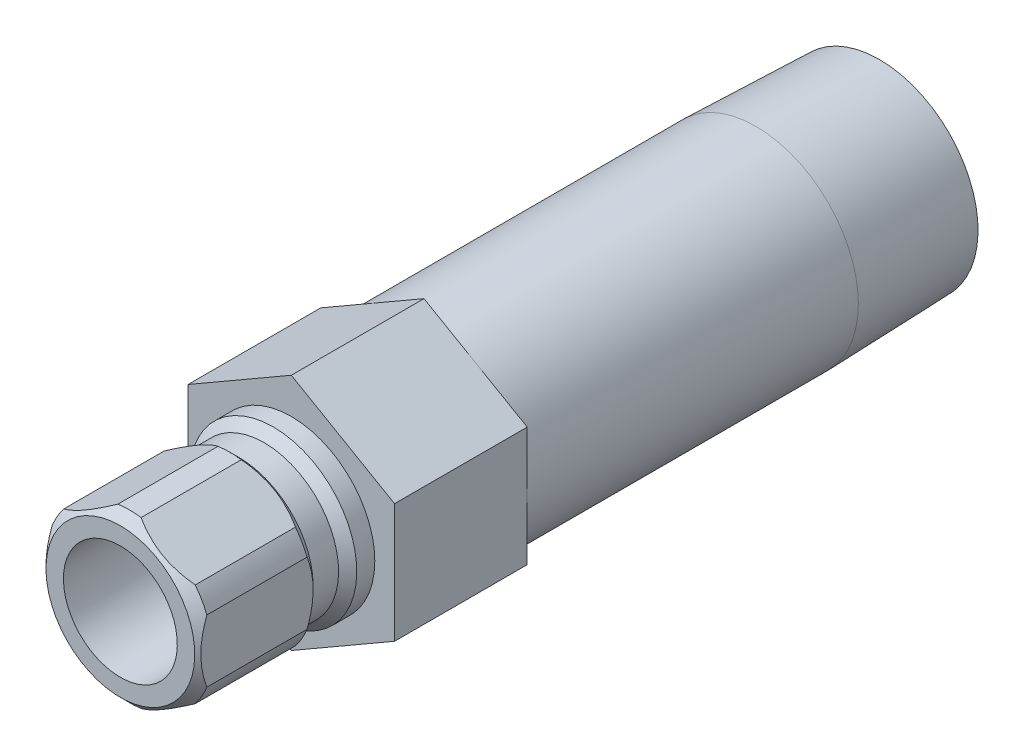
ISO-10303-21;
HEADER;
FILE_DESCRIPTION(('STEP AP214'),'2;1');
FILE_NAME('part.step','',(''),(''),'','','');
FILE_SCHEMA(('AUTOMOTIVE_DESIGN { 1 0 10303 214 1 1 1 1 }'));
ENDSEC;
DATA;
#1=APPLICATION_CONTEXT('core data for automotive mechanical design processes');
#2=APPLICATION_PROTOCOL_DEFINITION('international standard','automotive_design',2000,#1);
#3=PRODUCT_CONTEXT('',#1,'mechanical');
#4=PRODUCT('Part','Part','',(#3));
#5=PRODUCT_RELATED_PRODUCT_CATEGORY('part','',(#4));
#6=PRODUCT_DEFINITION_FORMATION('','',#4);
#7=PRODUCT_DEFINITION_CONTEXT('part definition',#1,'design');
#8=PRODUCT_DEFINITION('design','',#6,#7);
#9=PRODUCT_DEFINITION_SHAPE('','',#8);
#10=(LENGTH_UNIT() NAMED_UNIT(*) SI_UNIT(.MILLI.,.METRE.));
#11=(NAMED_UNIT(*) PLANE_ANGLE_UNIT() SI_UNIT($,.RADIAN.));
#12=(NAMED_UNIT(*) SI_UNIT($,.STERADIAN.) SOLID_ANGLE_UNIT());
#13=UNCERTAINTY_MEASURE_WITH_UNIT(LENGTH_MEASURE(1.E-05),#10,'distance_accuracy_value','');
#14=(GEOMETRIC_REPRESENTATION_CONTEXT(3) GLOBAL_UNCERTAINTY_ASSIGNED_CONTEXT((#13)) GLOBAL_UNIT_ASSIGNED_CONTEXT((#10,
#11,#12)) REPRESENTATION_CONTEXT('',''));
#15=CARTESIAN_POINT('',(0.,0.,0.));
#16=DIRECTION('',(0.,0.,1.));
#17=DIRECTION('',(1.,0.,0.));
#18=AXIS2_PLACEMENT_3D('',#15,#16,#17);
#19=CARTESIAN_POINT('',(0.,0.,0.));
#20=DIRECTION('',(0.,0.,-1.));
#21=DIRECTION('',(0.,1.,0.));
#22=AXIS2_PLACEMENT_3D('',#19,#20,#21);
#23=CYLINDRICAL_SURFACE('',#22,6.985);
#24=DIRECTION('',(0.,0.,-1.));
#25=VECTOR('',#24,1.);
#26=CARTESIAN_POINT('',(5.50323442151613,-4.30170151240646,0.));
#27=LINE('',#26,#25);
#28=CARTESIAN_POINT('',(5.50323442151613,-4.30170151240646,5.1562));
#29=VERTEX_POINT('',#28);
#30=CARTESIAN_POINT('',(5.50323442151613,-4.30170151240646,13.5382));
#31=VERTEX_POINT('',#30);
#32=EDGE_CURVE('E405',#29,#31,#27,.F.);
#33=ORIENTED_EDGE('',*,*,#32,.F.);
#34=CARTESIAN_POINT('',(0.,0.,5.1562));
#35=DIRECTION('',(0.,0.,-1.));
#36=DIRECTION('',(0.,1.,0.));
#37=AXIS2_PLACEMENT_3D('',#34,#35,#36);
#38=CIRCLE('',#37,6.985);
#39=CARTESIAN_POINT('',(6.477,-2.6150900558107,5.1562));
#40=VERTEX_POINT('',#39);
#41=EDGE_CURVE('E382',#40,#29,#38,.T.);
#42=ORIENTED_EDGE('',*,*,#41,.F.);
#43=DIRECTION('',(0.,0.,-1.));
#44=VECTOR('',#43,1.);
#45=CARTESIAN_POINT('',(6.477,-2.6150900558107,0.));
#46=LINE('',#45,#44);
#47=CARTESIAN_POINT('',(6.477,-2.6150900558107,13.5382));
#48=VERTEX_POINT('',#47);
#49=EDGE_CURVE('E396',#48,#40,#46,.T.);
#50=ORIENTED_EDGE('',*,*,#49,.F.);
#51=CARTESIAN_POINT('',(0.,0.,13.5382));
#52=DIRECTION('',(0.,0.,-1.));
#53=DIRECTION('',(0.,1.,0.));
#54=AXIS2_PLACEMENT_3D('',#51,#52,#53);
#55=CIRCLE('',#54,6.985);
#56=EDGE_CURVE('E190',#48,#31,#55,.T.);
#57=ORIENTED_EDGE('',*,*,#56,.T.);
#58=EDGE_LOOP('',(#33,#42,#50,#57));
#59=FACE_BOUND('',#58,.T.);
#60=ADVANCED_FACE('F33',(#59),#23,.T.);
#61=DIRECTION('',(0.,0.,-1.));
#62=VECTOR('',#61,1.);
#63=CARTESIAN_POINT('',(6.477,2.61509005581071,0.));
#64=LINE('',#63,#62);
#65=CARTESIAN_POINT('',(6.477,2.6150900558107,5.1562));
#66=VERTEX_POINT('',#65);
#67=CARTESIAN_POINT('',(6.477,2.61509005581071,13.5382));
#68=VERTEX_POINT('',#67);
#69=EDGE_CURVE('E308',#66,#68,#64,.F.);
#70=ORIENTED_EDGE('',*,*,#69,.F.);
#71=CARTESIAN_POINT('',(5.50323442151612,4.30170151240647,5.1562));
#72=VERTEX_POINT('',#71);
#73=EDGE_CURVE('E203',#72,#66,#38,.T.);
#74=ORIENTED_EDGE('',*,*,#73,.F.);
#75=DIRECTION('',(0.,0.,-1.));
#76=VECTOR('',#75,1.);
#77=CARTESIAN_POINT('',(5.50323442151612,4.30170151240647,0.));
#78=LINE('',#77,#76);
#79=CARTESIAN_POINT('',(5.50323442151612,4.30170151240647,13.5382));
#80=VERTEX_POINT('',#79);
#81=EDGE_CURVE('E393',#80,#72,#78,.T.);
#82=ORIENTED_EDGE('',*,*,#81,.F.);
#83=EDGE_CURVE('E197',#80,#68,#55,.T.);
#84=ORIENTED_EDGE('',*,*,#83,.T.);
#85=EDGE_LOOP('',(#70,#74,#82,#84));
#86=FACE_BOUND('',#85,.T.);
#87=ADVANCED_FACE('F342',(#86),#23,.T.);
#88=DIRECTION('',(0.,0.,-1.));
#89=VECTOR('',#88,1.);
#90=CARTESIAN_POINT('',(0.973765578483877,6.91679156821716,0.));
#91=LINE('',#90,#89);
#92=CARTESIAN_POINT('',(0.973765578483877,6.91679156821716,5.1562));
#93=VERTEX_POINT('',#92);
#94=CARTESIAN_POINT('',(0.973765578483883,6.91679156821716,13.5382));
#95=VERTEX_POINT('',#94);
#96=EDGE_CURVE('E398',#93,#95,#91,.F.);
#97=ORIENTED_EDGE('',*,*,#96,.F.);
#98=CARTESIAN_POINT('',(-0.973765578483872,6.91679156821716,5.1562));
#99=VERTEX_POINT('',#98);
#100=EDGE_CURVE('E199',#99,#93,#38,.T.);
#101=ORIENTED_EDGE('',*,*,#100,.F.);
#102=DIRECTION('',(0.,0.,-1.));
#103=VECTOR('',#102,1.);
#104=CARTESIAN_POINT('',(-0.973765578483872,6.91679156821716,0.));
#105=LINE('',#104,#103);
#106=CARTESIAN_POINT('',(-0.973765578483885,6.91679156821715,13.5382));
#107=VERTEX_POINT('',#106);
#108=EDGE_CURVE('E374',#107,#99,#105,.T.);
#109=ORIENTED_EDGE('',*,*,#108,.F.);
#110=EDGE_CURVE('E192',#107,#95,#55,.T.);
#111=ORIENTED_EDGE('',*,*,#110,.T.);
#112=EDGE_LOOP('',(#97,#101,#109,#111));
#113=FACE_BOUND('',#112,.T.);
#114=ADVANCED_FACE('F347',(#113),#23,.T.);
#115=DIRECTION('',(0.,0.,-1.));
#116=VECTOR('',#115,1.);
#117=CARTESIAN_POINT('',(-5.50323442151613,4.30170151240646,0.));
#118=LINE('',#117,#116);
#119=CARTESIAN_POINT('',(-5.50323442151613,4.30170151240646,5.1562));
#120=VERTEX_POINT('',#119);
#121=CARTESIAN_POINT('',(-5.50323442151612,4.30170151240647,13.5382));
#122=VERTEX_POINT('',#121);
#123=EDGE_CURVE('E53',#120,#122,#118,.F.);
#124=ORIENTED_EDGE('',*,*,#123,.F.);
#125=CARTESIAN_POINT('',(-6.477,2.61509005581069,5.1562));
#126=VERTEX_POINT('',#125);
#127=EDGE_CURVE('E202',#126,#120,#38,.T.);
#128=ORIENTED_EDGE('',*,*,#127,.F.);
#129=DIRECTION('',(0.,0.,-1.));
#130=VECTOR('',#129,1.);
#131=CARTESIAN_POINT('',(-6.477,2.61509005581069,0.));
#132=LINE('',#131,#130);
#133=CARTESIAN_POINT('',(-6.477,2.61509005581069,13.5382));
#134=VERTEX_POINT('',#133);
#135=EDGE_CURVE('E262',#134,#126,#132,.T.);
#136=ORIENTED_EDGE('',*,*,#135,.F.);
#137=EDGE_CURVE('E188',#134,#122,#55,.T.);
#138=ORIENTED_EDGE('',*,*,#137,.T.);
#139=EDGE_LOOP('',(#124,#128,#136,#138));
#140=FACE_BOUND('',#139,.T.);
#141=ADVANCED_FACE('F359',(#140),#23,.T.);
#142=DIRECTION('',(0.,0.,-1.));
#143=VECTOR('',#142,1.);
#144=CARTESIAN_POINT('',(-6.477,-2.61509005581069,0.));
#145=LINE('',#144,#143);
#146=CARTESIAN_POINT('',(-6.477,-2.61509005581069,5.1562));
#147=VERTEX_POINT('',#146);
#148=CARTESIAN_POINT('',(-6.477,-2.6150900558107,13.5382));
#149=VERTEX_POINT('',#148);
#150=EDGE_CURVE('E61',#147,#149,#145,.F.);
#151=ORIENTED_EDGE('',*,*,#150,.F.);
#152=CARTESIAN_POINT('',(-5.50323442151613,-4.30170151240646,5.1562));
#153=VERTEX_POINT('',#152);
#154=EDGE_CURVE('E181',#153,#147,#38,.T.);
#155=ORIENTED_EDGE('',*,*,#154,.F.);
#156=DIRECTION('',(0.,0.,-1.));
#157=VECTOR('',#156,1.);
#158=CARTESIAN_POINT('',(-5.50323442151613,-4.30170151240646,0.));
#159=LINE('',#158,#157);
#160=CARTESIAN_POINT('',(-5.50323442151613,-4.30170151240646,13.5382));
#161=VERTEX_POINT('',#160);
#162=EDGE_CURVE('E164',#161,#153,#159,.T.);
#163=ORIENTED_EDGE('',*,*,#162,.F.);
#164=EDGE_CURVE('E179',#161,#149,#55,.T.);
#165=ORIENTED_EDGE('',*,*,#164,.T.);
#166=EDGE_LOOP('',(#151,#155,#163,#165));
#167=FACE_BOUND('',#166,.T.);
#168=ADVANCED_FACE('F178',(#167),#23,.T.);
#169=CARTESIAN_POINT('',(0.,0.,0.));
#170=DIRECTION('',(0.,0.,-1.));
#171=DIRECTION('',(0.,1.,0.));
#172=AXIS2_PLACEMENT_3D('',#169,#170,#171);
#173=CYLINDRICAL_SURFACE('',#172,8.57249999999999);
#174=CARTESIAN_POINT('',(0.,0.,-38.862));
#175=DIRECTION('',(0.,0.,-1.));
#176=DIRECTION('',(0.,1.,0.));
#177=AXIS2_PLACEMENT_3D('',#174,#175,#176);
#178=CIRCLE('',#177,8.57249999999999);
#179=CARTESIAN_POINT('',(0.,8.5725,-38.862));
#180=VERTEX_POINT('',#179);
#181=EDGE_CURVE('E213',#180,#180,#178,.T.);
#182=ORIENTED_EDGE('',*,*,#181,.F.);
#183=EDGE_LOOP('',(#182));
#184=FACE_BOUND('',#183,.T.);
#185=CARTESIAN_POINT('',(0.,0.,-11.0998));
#186=DIRECTION('',(0.,0.,1.));
#187=DIRECTION('',(1.,0.,0.));
#188=AXIS2_PLACEMENT_3D('',#185,#186,#187);
#189=CIRCLE('',#188,8.57249999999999);
#190=CARTESIAN_POINT('',(8.57249999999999,0.,-11.0998));
#191=VERTEX_POINT('',#190);
#192=EDGE_CURVE('E230',#191,#191,#189,.F.);
#193=ORIENTED_EDGE('',*,*,#192,.T.);
#194=EDGE_LOOP('',(#193));
#195=FACE_BOUND('',#194,.T.);
#196=ADVANCED_FACE('F358',(#184,#195),#173,.T.);
#197=CARTESIAN_POINT('',(0.,0.,0.));
#198=DIRECTION('',(0.,0.,-1.));
#199=DIRECTION('',(0.,1.,0.));
#200=AXIS2_PLACEMENT_3D('',#197,#198,#199);
#201=CYLINDRICAL_SURFACE('',#200,4.7625);
#202=CARTESIAN_POINT('',(0.,0.,14.3002));
#203=DIRECTION('',(0.,0.,-1.));
#204=DIRECTION('',(0.,1.,0.));
#205=AXIS2_PLACEMENT_3D('',#202,#203,#204);
#206=CIRCLE('',#205,4.7625);
#207=CARTESIAN_POINT('',(0.,4.7625,14.3002));
#208=VERTEX_POINT('',#207);
#209=EDGE_CURVE('E232',#208,#208,#206,.T.);
#210=ORIENTED_EDGE('',*,*,#209,.F.);
#211=EDGE_LOOP('',(#210));
#212=FACE_BOUND('',#211,.T.);
#213=CARTESIAN_POINT('',(0.,0.,-11.0998));
#214=DIRECTION('',(0.,0.,-1.));
#215=DIRECTION('',(0.,1.,0.));
#216=AXIS2_PLACEMENT_3D('',#213,#214,#215);
#217=CIRCLE('',#216,4.7625);
#218=CARTESIAN_POINT('',(0.,4.7625,-11.0998));
#219=VERTEX_POINT('',#218);
#220=EDGE_CURVE('E225',#219,#219,#217,.T.);
#221=ORIENTED_EDGE('',*,*,#220,.T.);
#222=EDGE_LOOP('',(#221));
#223=FACE_BOUND('',#222,.T.);
#224=ADVANCED_FACE('F35',(#212,#223),#201,.F.);
#225=CARTESIAN_POINT('',(0.,4.7625,-11.0998));
#226=DIRECTION('',(0.,0.,-1.));
#227=DIRECTION('',(0.,1.,0.));
#228=AXIS2_PLACEMENT_3D('',#225,#226,#227);
#229=PLANE('',#228);
#230=CARTESIAN_POINT('',(0.,0.,-11.0998));
#231=DIRECTION('',(0.,0.,-1.));
#232=DIRECTION('',(0.,1.,0.));
#233=AXIS2_PLACEMENT_3D('',#230,#231,#232);
#234=CIRCLE('',#233,6.2611);
#235=CARTESIAN_POINT('',(0.,6.2611,-11.0998));
#236=VERTEX_POINT('',#235);
#237=EDGE_CURVE('E222',#236,#236,#234,.T.);
#238=ORIENTED_EDGE('',*,*,#237,.T.);
#239=EDGE_LOOP('',(#238));
#240=FACE_BOUND('',#239,.T.);
#241=ORIENTED_EDGE('',*,*,#220,.F.);
#242=EDGE_LOOP('',(#241));
#243=FACE_BOUND('',#242,.T.);
#244=ADVANCED_FACE('F686',(#240,#243),#229,.T.);
#245=CARTESIAN_POINT('',(0.,0.,0.));
#246=DIRECTION('',(0.,0.,-1.));
#247=DIRECTION('',(0.,1.,0.));
#248=AXIS2_PLACEMENT_3D('',#245,#246,#247);
#249=CYLINDRICAL_SURFACE('',#248,6.26109999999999);
#250=CARTESIAN_POINT('',(0.,0.,-49.1998));
#251=DIRECTION('',(0.,0.,-1.));
#252=DIRECTION('',(0.,1.,0.));
#253=AXIS2_PLACEMENT_3D('',#250,#251,#252);
#254=CIRCLE('',#253,6.26109999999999);
#255=CARTESIAN_POINT('',(0.,6.2611,-49.1998));
#256=VERTEX_POINT('',#255);
#257=EDGE_CURVE('E219',#256,#256,#254,.T.);
#258=ORIENTED_EDGE('',*,*,#257,.T.);
#259=EDGE_LOOP('',(#258));
#260=FACE_BOUND('',#259,.T.);
#261=ORIENTED_EDGE('',*,*,#237,.F.);
#262=EDGE_LOOP('',(#261));
#263=FACE_BOUND('',#262,.T.);
#264=ADVANCED_FACE('F677',(#260,#263),#249,.F.);
#265=CARTESIAN_POINT('',(0.,8.24944566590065,-49.1998));
#266=DIRECTION('',(0.,0.,-1.));
#267=DIRECTION('',(0.,1.,0.));
#268=AXIS2_PLACEMENT_3D('',#265,#266,#267);
#269=PLANE('',#268);
#270=CARTESIAN_POINT('',(0.,0.,-49.1998));
#271=DIRECTION('',(0.,0.,-1.));
#272=DIRECTION('',(0.,1.,0.));
#273=AXIS2_PLACEMENT_3D('',#270,#271,#272);
#274=CIRCLE('',#273,8.24944566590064);
#275=CARTESIAN_POINT('',(0.,8.24944566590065,-49.1998));
#276=VERTEX_POINT('',#275);
#277=EDGE_CURVE('E216',#276,#276,#274,.T.);
#278=ORIENTED_EDGE('',*,*,#277,.T.);
#279=EDGE_LOOP('',(#278));
#280=FACE_BOUND('',#279,.T.);
#281=ORIENTED_EDGE('',*,*,#257,.F.);
#282=EDGE_LOOP('',(#281));
#283=FACE_BOUND('',#282,.T.);
#284=ADVANCED_FACE('F668',(#280,#283),#269,.T.);
#285=CARTESIAN_POINT('',(0.,0.,-49.1998));
#286=DIRECTION('',(0.,0.,1.));
#287=DIRECTION('',(0.,-1.,0.));
#288=AXIS2_PLACEMENT_3D('',#285,#286,#287);
#289=CONICAL_SURFACE('',#288,8.24944566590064,0.0312396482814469);
#290=ORIENTED_EDGE('',*,*,#181,.T.);
#291=EDGE_LOOP('',(#290));
#292=FACE_BOUND('',#291,.T.);
#293=ORIENTED_EDGE('',*,*,#277,.F.);
#294=EDGE_LOOP('',(#293));
#295=FACE_BOUND('',#294,.T.);
#296=ADVANCED_FACE('F660',(#292,#295),#289,.T.);
#297=CARTESIAN_POINT('',(0.,0.,0.));
#298=DIRECTION('',(0.,0.,-1.));
#299=DIRECTION('',(0.,1.,0.));
#300=AXIS2_PLACEMENT_3D('',#297,#298,#299);
#301=CYLINDRICAL_SURFACE('',#300,6.985);
#302=CARTESIAN_POINT('',(0.,0.,0.));
#303=DIRECTION('',(0.,0.,1.));
#304=DIRECTION('',(1.,0.,0.));
#305=AXIS2_PLACEMENT_3D('',#302,#303,#304);
#306=CIRCLE('',#305,6.985);
#307=CARTESIAN_POINT('',(6.985,0.,0.));
#308=VERTEX_POINT('',#307);
#309=EDGE_CURVE('E173',#308,#308,#306,.F.);
#310=ORIENTED_EDGE('',*,*,#309,.F.);
#311=EDGE_LOOP('',(#310));
#312=FACE_BOUND('',#311,.T.);
#313=CARTESIAN_POINT('',(0.,0.,1.50876));
#314=DIRECTION('',(0.,0.,-1.));
#315=DIRECTION('',(0.,1.,0.));
#316=AXIS2_PLACEMENT_3D('',#313,#314,#315);
#317=CIRCLE('',#316,6.985);
#318=CARTESIAN_POINT('',(0.,6.985,1.50876));
#319=VERTEX_POINT('',#318);
#320=EDGE_CURVE('E210',#319,#319,#317,.T.);
#321=ORIENTED_EDGE('',*,*,#320,.T.);
#322=EDGE_LOOP('',(#321));
#323=FACE_BOUND('',#322,.T.);
#324=ADVANCED_FACE('F652',(#312,#323),#301,.T.);
#325=CARTESIAN_POINT('',(0.,0.,1.50876));
#326=DIRECTION('',(0.,0.,-1.));
#327=DIRECTION('',(0.,1.,0.));
#328=AXIS2_PLACEMENT_3D('',#325,#326,#327);
#329=CONICAL_SURFACE('',#328,6.985,0.785398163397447);
#330=CARTESIAN_POINT('',(0.,0.,2.27076));
#331=DIRECTION('',(0.,0.,-1.));
#332=DIRECTION('',(0.,1.,0.));
#333=AXIS2_PLACEMENT_3D('',#330,#331,#332);
#334=CIRCLE('',#333,6.223);
#335=CARTESIAN_POINT('',(0.,6.223,2.27076));
#336=VERTEX_POINT('',#335);
#337=EDGE_CURVE('E207',#336,#336,#334,.T.);
#338=ORIENTED_EDGE('',*,*,#337,.T.);
#339=EDGE_LOOP('',(#338));
#340=FACE_BOUND('',#339,.T.);
#341=ORIENTED_EDGE('',*,*,#320,.F.);
#342=EDGE_LOOP('',(#341));
#343=FACE_BOUND('',#342,.T.);
#344=ADVANCED_FACE('F644',(#340,#343),#329,.T.);
#345=CARTESIAN_POINT('',(0.,0.,0.));
#346=DIRECTION('',(0.,0.,-1.));
#347=DIRECTION('',(0.,1.,0.));
#348=AXIS2_PLACEMENT_3D('',#345,#346,#347);
#349=CYLINDRICAL_SURFACE('',#348,6.223);
#350=CARTESIAN_POINT('',(0.,0.,4.3942));
#351=DIRECTION('',(0.,0.,-1.));
#352=DIRECTION('',(0.,1.,0.));
#353=AXIS2_PLACEMENT_3D('',#350,#351,#352);
#354=CIRCLE('',#353,6.223);
#355=CARTESIAN_POINT('',(0.,6.223,4.3942));
#356=VERTEX_POINT('',#355);
#357=EDGE_CURVE('E204',#356,#356,#354,.T.);
#358=ORIENTED_EDGE('',*,*,#357,.T.);
#359=EDGE_LOOP('',(#358));
#360=FACE_BOUND('',#359,.T.);
#361=ORIENTED_EDGE('',*,*,#337,.F.);
#362=EDGE_LOOP('',(#361));
#363=FACE_BOUND('',#362,.T.);
#364=ADVANCED_FACE('F269',(#360,#363),#349,.T.);
#365=CARTESIAN_POINT('',(0.,0.,4.3942));
#366=DIRECTION('',(0.,0.,1.));
#367=DIRECTION('',(0.,-1.,0.));
#368=AXIS2_PLACEMENT_3D('',#365,#366,#367);
#369=CONICAL_SURFACE('',#368,6.223,0.785398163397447);
#370=CARTESIAN_POINT('',(0.97330298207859,-6.91705864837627,5.1564));
#371=CARTESIAN_POINT('',(1.1543052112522,-6.81255696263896,5.07808330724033));
#372=CARTESIAN_POINT('',(1.3378209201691,-6.70660411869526,5.00684558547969));
#373=CARTESIAN_POINT('',(1.70963160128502,-6.49193912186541,4.88134753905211));
#374=CARTESIAN_POINT('',(1.89793754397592,-6.38322063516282,4.82713086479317));
#375=CARTESIAN_POINT('',(2.27146153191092,-6.16756646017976,4.74047563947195));
#376=CARTESIAN_POINT('',(2.45655498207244,-6.06070270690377,4.70733772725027));
#377=CARTESIAN_POINT('',(2.82844640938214,-5.8459910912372,4.66198043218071));
#378=CARTESIAN_POINT('',(3.0152419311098,-5.73814464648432,4.64973461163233));
#379=CARTESIAN_POINT('',(3.3948057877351,-5.51900335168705,4.64689437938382));
#380=CARTESIAN_POINT('',(3.58757842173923,-5.40770601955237,4.65698827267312));
#381=CARTESIAN_POINT('',(3.97148128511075,-5.18605959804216,4.69952919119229));
#382=CARTESIAN_POINT('',(4.16260891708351,-5.07571200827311,4.73200667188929));
#383=CARTESIAN_POINT('',(4.54854122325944,-4.85289388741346,4.81877263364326));
#384=CARTESIAN_POINT('',(4.74321398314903,-4.74049951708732,4.87383522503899));
#385=CARTESIAN_POINT('',(5.03141021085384,-4.57410934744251,4.97019209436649));
#386=CARTESIAN_POINT('',(5.12673323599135,-4.51907457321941,5.00455772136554));
#387=CARTESIAN_POINT('',(5.31613879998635,-4.40972121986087,5.07745547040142));
#388=CARTESIAN_POINT('',(5.41022179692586,-4.35540237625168,5.11598600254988));
#389=CARTESIAN_POINT('',(5.5036970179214,-4.30143443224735,5.1564));
#390=B_SPLINE_CURVE_WITH_KNOTS('',3,(#370,#371,#372,#373,#374,#375,#376,#377,#378,#379,#380,
#381,#382,#383,#384,#385,#386,#387,#388,#389),.UNSPECIFIED.,.F.,.F.,(4,2,2,2,2,2,2,2,2,4),(0.,
0.66981096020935,1.34132587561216,1.98920541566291,2.63626449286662,3.3035366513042,
3.9717185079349,4.66502165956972,5.01088265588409,5.35661208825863),.UNSPECIFIED.);
#391=CARTESIAN_POINT('',(0.973765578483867,-6.91679156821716,5.1562));
#392=VERTEX_POINT('',#391);
#393=EDGE_CURVE('E407',#392,#29,#390,.T.);
#394=ORIENTED_EDGE('',*,*,#393,.F.);
#395=CARTESIAN_POINT('',(-0.973765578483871,-6.91679156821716,5.1562));
#396=VERTEX_POINT('',#395);
#397=EDGE_CURVE('E380',#392,#396,#38,.T.);
#398=ORIENTED_EDGE('',*,*,#397,.T.);
#399=CARTESIAN_POINT('',(-5.50369701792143,-4.30143443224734,5.15640000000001));
#400=CARTESIAN_POINT('',(-5.32269478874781,-4.40593611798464,5.07808330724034));
#401=CARTESIAN_POINT('',(-5.13917907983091,-4.51188896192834,5.0068455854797));
#402=CARTESIAN_POINT('',(-4.767368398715,-4.72655395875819,4.88134753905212));
#403=CARTESIAN_POINT('',(-4.5790624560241,-4.83527244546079,4.82713086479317));
#404=CARTESIAN_POINT('',(-4.20553846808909,-5.05092662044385,4.74047563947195));
#405=CARTESIAN_POINT('',(-4.02044501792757,-5.15779037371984,4.70733772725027));
#406=CARTESIAN_POINT('',(-3.64855359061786,-5.37250198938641,4.66198043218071));
#407=CARTESIAN_POINT('',(-3.4617580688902,-5.48034843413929,4.64973461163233));
#408=CARTESIAN_POINT('',(-3.0821942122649,-5.69948972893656,4.64689437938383));
#409=CARTESIAN_POINT('',(-2.88942157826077,-5.81078706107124,4.65698827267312));
#410=CARTESIAN_POINT('',(-2.50551871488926,-6.03243348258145,4.69952919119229));
#411=CARTESIAN_POINT('',(-2.3143910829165,-6.1427810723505,4.73200667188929));
#412=CARTESIAN_POINT('',(-1.92845877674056,-6.36559919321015,4.81877263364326));
#413=CARTESIAN_POINT('',(-1.73378601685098,-6.47799356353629,4.87383522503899));
#414=CARTESIAN_POINT('',(-1.44558978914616,-6.6443837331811,4.97019209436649));
#415=CARTESIAN_POINT('',(-1.35026676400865,-6.69941850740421,5.00455772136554));
#416=CARTESIAN_POINT('',(-1.16086120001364,-6.80877186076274,5.07745547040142));
#417=CARTESIAN_POINT('',(-1.06677820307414,-6.86309070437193,5.11598600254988));
#418=CARTESIAN_POINT('',(-0.973302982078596,-6.91705864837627,5.1564));
#419=B_SPLINE_CURVE_WITH_KNOTS('',3,(#399,#400,#401,#402,#403,#404,#405,#406,#407,#408,#409,
#410,#411,#412,#413,#414,#415,#416,#417,#418),.UNSPECIFIED.,.F.,.F.,(4,2,2,2,2,2,2,2,2,4),(0.,
0.669810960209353,1.34132587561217,1.98920541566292,2.63626449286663,3.30353665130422,
3.97171850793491,4.66502165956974,5.01088265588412,5.35661208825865),.UNSPECIFIED.);
#420=EDGE_CURVE('E255',#153,#396,#419,.T.);
#421=ORIENTED_EDGE('',*,*,#420,.F.);
#422=ORIENTED_EDGE('',*,*,#154,.T.);
#423=CARTESIAN_POINT('',(-6.477,-7.50531717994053,8.08489330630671));
#424=CARTESIAN_POINT('',(-6.477,-7.32278230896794,7.94673378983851));
#425=CARTESIAN_POINT('',(-6.477,-7.13923073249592,7.80989578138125));
#426=CARTESIAN_POINT('',(-6.477,-6.76969107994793,7.53945615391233));
#427=CARTESIAN_POINT('',(-6.477,-6.58370240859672,7.40585534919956));
#428=CARTESIAN_POINT('',(-6.477,-6.20752484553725,7.14153325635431));
#429=CARTESIAN_POINT('',(-6.477,-6.01731457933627,7.01084228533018));
#430=CARTESIAN_POINT('',(-6.477,-5.63367369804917,6.75429124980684));
#431=CARTESIAN_POINT('',(-6.477,-5.44024331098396,6.62843084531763));
#432=CARTESIAN_POINT('',(-6.477,-5.03831720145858,6.37548971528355));
#433=CARTESIAN_POINT('',(-6.477,-4.8295984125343,6.24876164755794));
#434=CARTESIAN_POINT('',(-6.477,-4.40728395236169,6.00357587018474));
#435=CARTESIAN_POINT('',(-6.477,-4.19368750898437,5.88511948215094));
#436=CARTESIAN_POINT('',(-6.477,-3.7616267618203,5.6590284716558));
#437=CARTESIAN_POINT('',(-6.477,-3.54317924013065,5.55136202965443));
#438=CARTESIAN_POINT('',(-6.477,-3.100295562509,5.34926153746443));
#439=CARTESIAN_POINT('',(-6.477,-2.87586219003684,5.25482146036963));
#440=CARTESIAN_POINT('',(-6.477,-2.43955826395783,5.0897033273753));
#441=CARTESIAN_POINT('',(-6.477,-2.22819339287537,5.0177028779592));
#442=CARTESIAN_POINT('',(-6.477,-1.80033354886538,4.89065249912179));
#443=CARTESIAN_POINT('',(-6.477,-1.58383822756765,4.8356037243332));
#444=CARTESIAN_POINT('',(-6.477,-1.15063390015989,4.74626140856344));
#445=CARTESIAN_POINT('',(-6.477,-0.93400006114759,4.71160936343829));
#446=CARTESIAN_POINT('',(-6.477,-0.498364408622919,4.66374056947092));
#447=CARTESIAN_POINT('',(-6.477,-0.279363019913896,4.65052003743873));
#448=CARTESIAN_POINT('',(-6.477,0.150697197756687,4.64651642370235));
#449=CARTESIAN_POINT('',(-6.477,0.361748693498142,4.6549176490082));
#450=CARTESIAN_POINT('',(-6.477,0.782066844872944,4.69188275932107));
#451=CARTESIAN_POINT('',(-6.477,0.991333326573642,4.72044858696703));
#452=CARTESIAN_POINT('',(-6.477,1.41010575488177,4.79666246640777));
#453=CARTESIAN_POINT('',(-6.477,1.6195513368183,4.84463689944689));
#454=CARTESIAN_POINT('',(-6.477,2.03387291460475,4.95709535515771));
#455=CARTESIAN_POINT('',(-6.477,2.23874927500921,5.0215780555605));
#456=CARTESIAN_POINT('',(-6.477,2.66141718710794,5.17064013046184));
#457=CARTESIAN_POINT('',(-6.477,2.87875617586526,5.25648961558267));
#458=CARTESIAN_POINT('',(-6.477,3.30779766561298,5.44138196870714));
#459=CARTESIAN_POINT('',(-6.477,3.51949749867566,5.54043095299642));
#460=CARTESIAN_POINT('',(-6.477,3.93828980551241,5.74936705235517));
#461=CARTESIAN_POINT('',(-6.477,4.14536521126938,5.85928810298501));
#462=CARTESIAN_POINT('',(-6.477,4.5547539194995,6.0875403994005));
#463=CARTESIAN_POINT('',(-6.477,4.75706796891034,6.20587031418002));
#464=CARTESIAN_POINT('',(-6.477,5.1476137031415,6.44323908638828));
#465=CARTESIAN_POINT('',(-6.477,5.33604552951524,6.56195038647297));
#466=CARTESIAN_POINT('',(-6.477,5.70967381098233,6.80437488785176));
#467=CARTESIAN_POINT('',(-6.477,5.89487001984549,6.92808846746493));
#468=CARTESIAN_POINT('',(-6.477,6.26095063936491,7.17860412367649));
#469=CARTESIAN_POINT('',(-6.477,6.44185783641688,7.30537302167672));
#470=CARTESIAN_POINT('',(-6.477,6.80119835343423,7.56227065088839));
#471=CARTESIAN_POINT('',(-6.477,6.97963234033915,7.69239844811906));
#472=CARTESIAN_POINT('',(-6.477,7.15703038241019,7.82389977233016));
#473=B_SPLINE_CURVE_WITH_KNOTS('',3,(#423,#424,#425,#426,#427,#428,#429,#430,#431,#432,#433,
#434,#435,#436,#437,#438,#439,#440,#441,#442,#443,#444,#445,#446,#447,#448,#449,#450,#451,#452,
#453,#454,#455,#456,#457,#458,#459,#460,#461,#462,#463,#464,#465,#466,#467,#468,#469,#470,#471,
#472),.UNSPECIFIED.,.F.,.F.,(4,2,2,2,2,2,2,2,2,2,2,2,2,2,2,2,2,2,2,2,2,2,2,2,4),(0.,
0.686790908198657,1.37375281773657,2.06603541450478,2.75826919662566,3.49065471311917,
4.22315698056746,4.95343127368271,5.68337170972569,6.35265989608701,7.02199365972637,
7.67918147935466,8.33625327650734,8.96890298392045,9.6016136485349,10.2454384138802,
10.8892116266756,11.5897073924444,12.2905288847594,12.9936114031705,13.6965828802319,
14.3646145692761,15.0326968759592,15.6953618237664,16.3578444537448),.UNSPECIFIED.);
#474=EDGE_CURVE('E278',#126,#147,#473,.F.);
#475=ORIENTED_EDGE('',*,*,#474,.F.);
#476=ORIENTED_EDGE('',*,*,#127,.T.);
#477=CARTESIAN_POINT('',(-0.973302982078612,6.91705864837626,5.1564));
#478=CARTESIAN_POINT('',(-1.15430521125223,6.81255696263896,5.07808330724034));
#479=CARTESIAN_POINT('',(-1.33782092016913,6.70660411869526,5.00684558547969));
#480=CARTESIAN_POINT('',(-1.70963160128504,6.49193912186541,4.88134753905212));
#481=CARTESIAN_POINT('',(-1.89793754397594,6.38322063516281,4.82713086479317));
#482=CARTESIAN_POINT('',(-2.27146153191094,6.16756646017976,4.74047563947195));
#483=CARTESIAN_POINT('',(-2.45655498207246,6.06070270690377,4.70733772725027));
#484=CARTESIAN_POINT('',(-2.82844640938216,5.8459910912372,4.66198043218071));
#485=CARTESIAN_POINT('',(-3.01524193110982,5.73814464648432,4.64973461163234));
#486=CARTESIAN_POINT('',(-3.39480578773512,5.51900335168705,4.64689437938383));
#487=CARTESIAN_POINT('',(-3.58757842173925,5.40770601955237,4.65698827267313));
#488=CARTESIAN_POINT('',(-3.97148128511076,5.18605959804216,4.6995291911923));
#489=CARTESIAN_POINT('',(-4.16260891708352,5.07571200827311,4.7320066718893));
#490=CARTESIAN_POINT('',(-4.54854122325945,4.85289388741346,4.81877263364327));
#491=CARTESIAN_POINT('',(-4.74321398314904,4.74049951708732,4.873835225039));
#492=CARTESIAN_POINT('',(-5.03141021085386,4.57410934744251,4.9701920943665));
#493=CARTESIAN_POINT('',(-5.12673323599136,4.51907457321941,5.00455772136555));
#494=CARTESIAN_POINT('',(-5.31613879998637,4.40972121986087,5.07745547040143));
#495=CARTESIAN_POINT('',(-5.41022179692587,4.35540237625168,5.11598600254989));
#496=CARTESIAN_POINT('',(-5.50369701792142,4.30143443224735,5.15640000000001));
#497=B_SPLINE_CURVE_WITH_KNOTS('',3,(#477,#478,#479,#480,#481,#482,#483,#484,#485,#486,#487,
#488,#489,#490,#491,#492,#493,#494,#495,#496),.UNSPECIFIED.,.F.,.F.,(4,2,2,2,2,2,2,2,2,4),(0.,
0.669810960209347,1.34132587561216,1.9892054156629,2.63626449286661,3.30353665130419,
3.97171850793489,4.66502165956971,5.01088265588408,5.35661208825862),.UNSPECIFIED.);
#498=EDGE_CURVE('E285',#99,#120,#497,.T.);
#499=ORIENTED_EDGE('',*,*,#498,.F.);
#500=ORIENTED_EDGE('',*,*,#100,.T.);
#501=CARTESIAN_POINT('',(5.50369701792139,4.30143443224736,5.1564));
#502=CARTESIAN_POINT('',(5.32269478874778,4.40593611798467,5.07808330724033));
#503=CARTESIAN_POINT('',(5.13917907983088,4.51188896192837,5.00684558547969));
#504=CARTESIAN_POINT('',(4.76736839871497,4.72655395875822,4.88134753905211));
#505=CARTESIAN_POINT('',(4.57906245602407,4.83527244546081,4.82713086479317));
#506=CARTESIAN_POINT('',(4.20553846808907,5.05092662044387,4.74047563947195));
#507=CARTESIAN_POINT('',(4.02044501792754,5.15779037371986,4.70733772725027));
#508=CARTESIAN_POINT('',(3.64855359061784,5.37250198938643,4.66198043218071));
#509=CARTESIAN_POINT('',(3.46175806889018,5.48034843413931,4.64973461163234));
#510=CARTESIAN_POINT('',(3.08219421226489,5.69948972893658,4.64689437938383));
#511=CARTESIAN_POINT('',(2.88942157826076,5.81078706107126,4.65698827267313));
#512=CARTESIAN_POINT('',(2.50551871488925,6.03243348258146,4.6995291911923));
#513=CARTESIAN_POINT('',(2.31439108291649,6.14278107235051,4.7320066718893));
#514=CARTESIAN_POINT('',(1.92845877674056,6.36559919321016,4.81877263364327));
#515=CARTESIAN_POINT('',(1.73378601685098,6.47799356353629,4.87383522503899));
#516=CARTESIAN_POINT('',(1.44558978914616,6.6443837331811,4.97019209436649));
#517=CARTESIAN_POINT('',(1.35026676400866,6.69941850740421,5.00455772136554));
#518=CARTESIAN_POINT('',(1.16086120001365,6.80877186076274,5.07745547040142));
#519=CARTESIAN_POINT('',(1.06677820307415,6.86309070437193,5.11598600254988));
#520=CARTESIAN_POINT('',(0.97330298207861,6.91705864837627,5.1564));
#521=B_SPLINE_CURVE_WITH_KNOTS('',3,(#501,#502,#503,#504,#505,#506,#507,#508,#509,#510,#511,
#512,#513,#514,#515,#516,#517,#518,#519,#520),.UNSPECIFIED.,.F.,.F.,(4,2,2,2,2,2,2,2,2,4),(0.,
0.669810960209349,1.34132587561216,1.9892054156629,2.63626449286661,3.30353665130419,
3.97171850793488,4.66502165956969,5.01088265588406,5.35661208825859),.UNSPECIFIED.);
#522=EDGE_CURVE('E292',#72,#93,#521,.T.);
#523=ORIENTED_EDGE('',*,*,#522,.F.);
#524=ORIENTED_EDGE('',*,*,#73,.T.);
#525=CARTESIAN_POINT('',(6.477,-7.50531717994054,8.08489330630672));
#526=CARTESIAN_POINT('',(6.477,-7.32278230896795,7.94673378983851));
#527=CARTESIAN_POINT('',(6.477,-7.13923073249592,7.80989578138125));
#528=CARTESIAN_POINT('',(6.477,-6.76969107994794,7.53945615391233));
#529=CARTESIAN_POINT('',(6.477,-6.58370240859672,7.40585534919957));
#530=CARTESIAN_POINT('',(6.477,-6.20752484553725,7.14153325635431));
#531=CARTESIAN_POINT('',(6.477,-6.01731457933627,7.01084228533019));
#532=CARTESIAN_POINT('',(6.477,-5.63367369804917,6.75429124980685));
#533=CARTESIAN_POINT('',(6.477,-5.44024331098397,6.62843084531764));
#534=CARTESIAN_POINT('',(6.477,-5.03831720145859,6.37548971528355));
#535=CARTESIAN_POINT('',(6.477,-4.8295984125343,6.24876164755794));
#536=CARTESIAN_POINT('',(6.477,-4.4072839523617,6.00357587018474));
#537=CARTESIAN_POINT('',(6.477,-4.19368750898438,5.88511948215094));
#538=CARTESIAN_POINT('',(6.477,-3.7616267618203,5.6590284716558));
#539=CARTESIAN_POINT('',(6.477,-3.54317924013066,5.55136202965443));
#540=CARTESIAN_POINT('',(6.477,-3.100295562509,5.34926153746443));
#541=CARTESIAN_POINT('',(6.477,-2.87586219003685,5.25482146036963));
#542=CARTESIAN_POINT('',(6.477,-2.43955826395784,5.08970332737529));
#543=CARTESIAN_POINT('',(6.477,-2.22819339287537,5.0177028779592));
#544=CARTESIAN_POINT('',(6.477,-1.80033354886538,4.89065249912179));
#545=CARTESIAN_POINT('',(6.477,-1.58383822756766,4.8356037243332));
#546=CARTESIAN_POINT('',(6.477,-1.15063390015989,4.74626140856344));
#547=CARTESIAN_POINT('',(6.477,-0.934000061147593,4.71160936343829));
#548=CARTESIAN_POINT('',(6.477,-0.498364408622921,4.66374056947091));
#549=CARTESIAN_POINT('',(6.477,-0.279363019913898,4.65052003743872));
#550=CARTESIAN_POINT('',(6.477,0.150697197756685,4.64651642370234));
#551=CARTESIAN_POINT('',(6.477,0.36174869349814,4.6549176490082));
#552=CARTESIAN_POINT('',(6.477,0.782066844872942,4.69188275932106));
#553=CARTESIAN_POINT('',(6.477,0.99133332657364,4.72044858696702));
#554=CARTESIAN_POINT('',(6.477,1.41010575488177,4.79666246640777));
#555=CARTESIAN_POINT('',(6.477,1.6195513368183,4.84463689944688));
#556=CARTESIAN_POINT('',(6.477,2.03387291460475,4.95709535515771));
#557=CARTESIAN_POINT('',(6.477,2.23874927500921,5.02157805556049));
#558=CARTESIAN_POINT('',(6.477,2.66141718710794,5.17064013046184));
#559=CARTESIAN_POINT('',(6.477,2.87875617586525,5.25648961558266));
#560=CARTESIAN_POINT('',(6.477,3.30779766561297,5.44138196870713));
#561=CARTESIAN_POINT('',(6.477,3.51949749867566,5.54043095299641));
#562=CARTESIAN_POINT('',(6.477,3.93828980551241,5.74936705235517));
#563=CARTESIAN_POINT('',(6.477,4.14536521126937,5.859288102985));
#564=CARTESIAN_POINT('',(6.477,4.55475391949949,6.08754039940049));
#565=CARTESIAN_POINT('',(6.477,4.75706796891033,6.20587031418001));
#566=CARTESIAN_POINT('',(6.477,5.14761370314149,6.44323908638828));
#567=CARTESIAN_POINT('',(6.477,5.33604552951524,6.56195038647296));
#568=CARTESIAN_POINT('',(6.477,5.70967381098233,6.80437488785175));
#569=CARTESIAN_POINT('',(6.477,5.89487001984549,6.92808846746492));
#570=CARTESIAN_POINT('',(6.477,6.2609506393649,7.17860412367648));
#571=CARTESIAN_POINT('',(6.477,6.44185783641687,7.30537302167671));
#572=CARTESIAN_POINT('',(6.477,6.80119835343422,7.56227065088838));
#573=CARTESIAN_POINT('',(6.477,6.97963234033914,7.69239844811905));
#574=CARTESIAN_POINT('',(6.477,7.15703038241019,7.82389977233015));
#575=B_SPLINE_CURVE_WITH_KNOTS('',3,(#525,#526,#527,#528,#529,#530,#531,#532,#533,#534,#535,
#536,#537,#538,#539,#540,#541,#542,#543,#544,#545,#546,#547,#548,#549,#550,#551,#552,#553,#554,
#555,#556,#557,#558,#559,#560,#561,#562,#563,#564,#565,#566,#567,#568,#569,#570,#571,#572,#573,
#574),.UNSPECIFIED.,.F.,.F.,(4,2,2,2,2,2,2,2,2,2,2,2,2,2,2,2,2,2,2,2,2,2,2,2,4),(0.,
0.686790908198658,1.37375281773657,2.06603541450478,2.75826919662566,3.49065471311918,
4.22315698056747,4.95343127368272,5.6833717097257,6.35265989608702,7.02199365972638,
7.67918147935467,8.33625327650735,8.96890298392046,9.60161364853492,10.2454384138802,
10.8892116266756,11.5897073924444,12.2905288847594,12.9936114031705,13.6965828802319,
14.3646145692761,15.0326968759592,15.6953618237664,16.3578444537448),.UNSPECIFIED.);
#576=EDGE_CURVE('E300',#40,#66,#575,.T.);
#577=ORIENTED_EDGE('',*,*,#576,.F.);
#578=ORIENTED_EDGE('',*,*,#41,.T.);
#579=EDGE_LOOP('',(#394,#398,#421,#422,#475,#476,#499,#500,#523,#524,#577,#578));
#580=FACE_BOUND('',#579,.T.);
#581=ORIENTED_EDGE('',*,*,#357,.F.);
#582=EDGE_LOOP('',(#581));
#583=FACE_BOUND('',#582,.T.);
#584=ADVANCED_FACE('F264',(#580,#583),#369,.T.);
#585=DIRECTION('',(0.,0.,-1.));
#586=VECTOR('',#585,1.);
#587=CARTESIAN_POINT('',(0.973765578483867,-6.91679156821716,0.));
#588=LINE('',#587,#586);
#589=CARTESIAN_POINT('',(0.973765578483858,-6.91679156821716,13.5382));
#590=VERTEX_POINT('',#589);
#591=EDGE_CURVE('E307',#590,#392,#588,.T.);
#592=ORIENTED_EDGE('',*,*,#591,.F.);
#593=CARTESIAN_POINT('',(-0.973765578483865,-6.91679156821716,13.5382));
#594=VERTEX_POINT('',#593);
#595=EDGE_CURVE('E187',#590,#594,#55,.T.);
#596=ORIENTED_EDGE('',*,*,#595,.T.);
#597=DIRECTION('',(0.,0.,-1.));
#598=VECTOR('',#597,1.);
#599=CARTESIAN_POINT('',(-0.973765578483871,-6.91679156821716,0.));
#600=LINE('',#599,#598);
#601=EDGE_CURVE('E167',#396,#594,#600,.F.);
#602=ORIENTED_EDGE('',*,*,#601,.F.);
#603=ORIENTED_EDGE('',*,*,#397,.F.);
#604=EDGE_LOOP('',(#592,#596,#602,#603));
#605=FACE_BOUND('',#604,.T.);
#606=ADVANCED_FACE('F268',(#605),#23,.T.);
#607=CARTESIAN_POINT('',(0.,0.,13.5382));
#608=DIRECTION('',(0.,0.,-1.));
#609=DIRECTION('',(0.,1.,0.));
#610=AXIS2_PLACEMENT_3D('',#607,#608,#609);
#611=CONICAL_SURFACE('',#610,6.985,0.785398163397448);
#612=CARTESIAN_POINT('',(5.5036970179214,-4.30143443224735,13.538));
#613=CARTESIAN_POINT('',(5.32269478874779,-4.40593611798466,13.6163166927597));
#614=CARTESIAN_POINT('',(5.13917907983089,-4.51188896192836,13.6875544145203));
#615=CARTESIAN_POINT('',(4.76736839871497,-4.72655395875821,13.8130524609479));
#616=CARTESIAN_POINT('',(4.57906245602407,-4.8352724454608,13.8672691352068));
#617=CARTESIAN_POINT('',(4.20553846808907,-5.05092662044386,13.953924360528));
#618=CARTESIAN_POINT('',(4.02044501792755,-5.15779037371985,13.9870622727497));
#619=CARTESIAN_POINT('',(3.64855359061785,-5.37250198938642,14.0324195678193));
#620=CARTESIAN_POINT('',(3.46175806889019,-5.4803484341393,14.0446653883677));
#621=CARTESIAN_POINT('',(3.08219421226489,-5.69948972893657,14.0475056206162));
#622=CARTESIAN_POINT('',(2.88942157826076,-5.81078706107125,14.0374117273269));
#623=CARTESIAN_POINT('',(2.50551871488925,-6.03243348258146,13.9948708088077));
#624=CARTESIAN_POINT('',(2.31439108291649,-6.14278107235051,13.9623933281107));
#625=CARTESIAN_POINT('',(1.92845877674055,-6.36559919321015,13.8756273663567));
#626=CARTESIAN_POINT('',(1.73378601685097,-6.47799356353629,13.820564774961));
#627=CARTESIAN_POINT('',(1.44558978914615,-6.6443837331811,13.7242079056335));
#628=CARTESIAN_POINT('',(1.35026676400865,-6.69941850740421,13.6898422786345));
#629=CARTESIAN_POINT('',(1.16086120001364,-6.80877186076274,13.6169445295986));
#630=CARTESIAN_POINT('',(1.06677820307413,-6.86309070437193,13.5784139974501));
#631=CARTESIAN_POINT('',(0.973302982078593,-6.91705864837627,13.538));
#632=B_SPLINE_CURVE_WITH_KNOTS('',3,(#612,#613,#614,#615,#616,#617,#618,#619,#620,#621,#622,
#623,#624,#625,#626,#627,#628,#629,#630,#631),.UNSPECIFIED.,.F.,.F.,(4,2,2,2,2,2,2,2,2,4),(0.,
0.669810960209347,1.34132587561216,1.9892054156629,2.63626449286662,3.3035366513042,
3.97171850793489,4.66502165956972,5.01088265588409,5.35661208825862),.UNSPECIFIED.);
#633=EDGE_CURVE('E12',#31,#590,#632,.T.);
#634=ORIENTED_EDGE('',*,*,#633,.F.);
#635=ORIENTED_EDGE('',*,*,#56,.F.);
#636=CARTESIAN_POINT('',(6.477,-7.50531717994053,10.6095066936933));
#637=CARTESIAN_POINT('',(6.477,-7.32278230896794,10.7476662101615));
#638=CARTESIAN_POINT('',(6.477,-7.13923073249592,10.8845042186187));
#639=CARTESIAN_POINT('',(6.477,-6.76969107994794,11.1549438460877));
#640=CARTESIAN_POINT('',(6.477,-6.58370240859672,11.2885446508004));
#641=CARTESIAN_POINT('',(6.477,-6.20752484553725,11.5528667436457));
#642=CARTESIAN_POINT('',(6.477,-6.01731457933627,11.6835577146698));
#643=CARTESIAN_POINT('',(6.477,-5.63367369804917,11.9401087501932));
#644=CARTESIAN_POINT('',(6.477,-5.44024331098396,12.0659691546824));
#645=CARTESIAN_POINT('',(6.477,-5.03831720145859,12.3189102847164));
#646=CARTESIAN_POINT('',(6.477,-4.8295984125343,12.4456383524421));
#647=CARTESIAN_POINT('',(6.477,-4.4072839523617,12.6908241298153));
#648=CARTESIAN_POINT('',(6.477,-4.19368750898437,12.8092805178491));
#649=CARTESIAN_POINT('',(6.477,-3.7616267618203,13.0353715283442));
#650=CARTESIAN_POINT('',(6.477,-3.54317924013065,13.1430379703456));
#651=CARTESIAN_POINT('',(6.477,-3.100295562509,13.3451384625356));
#652=CARTESIAN_POINT('',(6.477,-2.87586219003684,13.4395785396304));
#653=CARTESIAN_POINT('',(6.477,-2.43955826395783,13.6046966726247));
#654=CARTESIAN_POINT('',(6.477,-2.22819339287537,13.6766971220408));
#655=CARTESIAN_POINT('',(6.477,-1.80033354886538,13.8037475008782));
#656=CARTESIAN_POINT('',(6.477,-1.58383822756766,13.8587962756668));
#657=CARTESIAN_POINT('',(6.477,-1.15063390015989,13.9481385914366));
#658=CARTESIAN_POINT('',(6.477,-0.934000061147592,13.9827906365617));
#659=CARTESIAN_POINT('',(6.477,-0.49836440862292,14.0306594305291));
#660=CARTESIAN_POINT('',(6.477,-0.279363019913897,14.0438799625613));
#661=CARTESIAN_POINT('',(6.477,0.150697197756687,14.0478835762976));
#662=CARTESIAN_POINT('',(6.477,0.361748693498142,14.0394823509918));
#663=CARTESIAN_POINT('',(6.477,0.782066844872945,14.0025172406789));
#664=CARTESIAN_POINT('',(6.477,0.991333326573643,13.973951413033));
#665=CARTESIAN_POINT('',(6.477,1.41010575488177,13.8977375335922));
#666=CARTESIAN_POINT('',(6.477,1.6195513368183,13.8497631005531));
#667=CARTESIAN_POINT('',(6.477,2.03387291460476,13.7373046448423));
#668=CARTESIAN_POINT('',(6.477,2.23874927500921,13.6728219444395));
#669=CARTESIAN_POINT('',(6.477,2.66141718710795,13.5237598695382));
#670=CARTESIAN_POINT('',(6.477,2.87875617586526,13.4379103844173));
#671=CARTESIAN_POINT('',(6.477,3.30779766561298,13.2530180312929));
#672=CARTESIAN_POINT('',(6.477,3.51949749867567,13.1539690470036));
#673=CARTESIAN_POINT('',(6.477,3.93828980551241,12.9450329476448));
#674=CARTESIAN_POINT('',(6.477,4.14536521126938,12.835111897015));
#675=CARTESIAN_POINT('',(6.477,4.5547539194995,12.6068596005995));
#676=CARTESIAN_POINT('',(6.477,4.75706796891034,12.48852968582));
#677=CARTESIAN_POINT('',(6.477,5.1476137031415,12.2511609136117));
#678=CARTESIAN_POINT('',(6.477,5.33604552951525,12.132449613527));
#679=CARTESIAN_POINT('',(6.477,5.70967381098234,11.8900251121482));
#680=CARTESIAN_POINT('',(6.477,5.8948700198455,11.7663115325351));
#681=CARTESIAN_POINT('',(6.477,6.26095063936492,11.5157958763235));
#682=CARTESIAN_POINT('',(6.477,6.44185783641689,11.3890269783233));
#683=CARTESIAN_POINT('',(6.477,6.80119835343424,11.1321293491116));
#684=CARTESIAN_POINT('',(6.477,6.97963234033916,11.0020015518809));
#685=CARTESIAN_POINT('',(6.477,7.15703038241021,10.8705002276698));
#686=B_SPLINE_CURVE_WITH_KNOTS('',3,(#636,#637,#638,#639,#640,#641,#642,#643,#644,#645,#646,
#647,#648,#649,#650,#651,#652,#653,#654,#655,#656,#657,#658,#659,#660,#661,#662,#663,#664,#665,
#666,#667,#668,#669,#670,#671,#672,#673,#674,#675,#676,#677,#678,#679,#680,#681,#682,#683,#684,
#685),.UNSPECIFIED.,.F.,.F.,(4,2,2,2,2,2,2,2,2,2,2,2,2,2,2,2,2,2,2,2,2,2,2,2,4),(0.,
0.686790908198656,1.37375281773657,2.06603541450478,2.75826919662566,3.49065471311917,
4.22315698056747,4.95343127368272,5.68337170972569,6.35265989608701,7.02199365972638,
7.67918147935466,8.33625327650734,8.96890298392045,9.60161364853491,10.2454384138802,
10.8892116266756,11.5897073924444,12.2905288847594,12.9936114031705,13.6965828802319,
14.3646145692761,15.0326968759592,15.6953618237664,16.3578444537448),.UNSPECIFIED.);
#687=EDGE_CURVE('E46',#68,#48,#686,.F.);
#688=ORIENTED_EDGE('',*,*,#687,.F.);
#689=ORIENTED_EDGE('',*,*,#83,.F.);
#690=CARTESIAN_POINT('',(0.97330298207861,6.91705864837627,13.538));
#691=CARTESIAN_POINT('',(1.15430521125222,6.81255696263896,13.6163166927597));
#692=CARTESIAN_POINT('',(1.33782092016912,6.70660411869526,13.6875544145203));
#693=CARTESIAN_POINT('',(1.70963160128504,6.49193912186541,13.8130524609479));
#694=CARTESIAN_POINT('',(1.89793754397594,6.38322063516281,13.8672691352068));
#695=CARTESIAN_POINT('',(2.27146153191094,6.16756646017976,13.953924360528));
#696=CARTESIAN_POINT('',(2.45655498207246,6.06070270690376,13.9870622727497));
#697=CARTESIAN_POINT('',(2.82844640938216,5.84599109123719,14.0324195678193));
#698=CARTESIAN_POINT('',(3.01524193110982,5.73814464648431,14.0446653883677));
#699=CARTESIAN_POINT('',(3.39480578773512,5.51900335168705,14.0475056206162));
#700=CARTESIAN_POINT('',(3.58757842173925,5.40770601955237,14.0374117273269));
#701=CARTESIAN_POINT('',(3.97148128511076,5.18605959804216,13.9948708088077));
#702=CARTESIAN_POINT('',(4.16260891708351,5.07571200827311,13.9623933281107));
#703=CARTESIAN_POINT('',(4.54854122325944,4.85289388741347,13.8756273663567));
#704=CARTESIAN_POINT('',(4.74321398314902,4.74049951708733,13.820564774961));
#705=CARTESIAN_POINT('',(5.03141021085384,4.57410934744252,13.7242079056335));
#706=CARTESIAN_POINT('',(5.12673323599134,4.51907457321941,13.6898422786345));
#707=CARTESIAN_POINT('',(5.31613879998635,4.40972121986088,13.6169445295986));
#708=CARTESIAN_POINT('',(5.41022179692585,4.3554023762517,13.5784139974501));
#709=CARTESIAN_POINT('',(5.50369701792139,4.30143443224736,13.538));
#710=B_SPLINE_CURVE_WITH_KNOTS('',3,(#690,#691,#692,#693,#694,#695,#696,#697,#698,#699,#700,
#701,#702,#703,#704,#705,#706,#707,#708,#709),.UNSPECIFIED.,.F.,.F.,(4,2,2,2,2,2,2,2,2,4),(0.,
0.669810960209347,1.34132587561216,1.98920541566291,2.63626449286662,3.30353665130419,
3.97171850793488,4.66502165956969,5.01088265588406,5.35661208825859),.UNSPECIFIED.);
#711=EDGE_CURVE('E324',#95,#80,#710,.T.);
#712=ORIENTED_EDGE('',*,*,#711,.F.);
#713=ORIENTED_EDGE('',*,*,#110,.F.);
#714=CARTESIAN_POINT('',(-5.50369701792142,4.30143443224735,13.538));
#715=CARTESIAN_POINT('',(-5.3226947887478,4.40593611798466,13.6163166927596));
#716=CARTESIAN_POINT('',(-5.1391790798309,4.51188896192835,13.6875544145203));
#717=CARTESIAN_POINT('',(-4.76736839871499,4.72655395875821,13.8130524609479));
#718=CARTESIAN_POINT('',(-4.57906245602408,4.8352724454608,13.8672691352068));
#719=CARTESIAN_POINT('',(-4.20553846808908,5.05092662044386,13.953924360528));
#720=CARTESIAN_POINT('',(-4.02044501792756,5.15779037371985,13.9870622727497));
#721=CARTESIAN_POINT('',(-3.64855359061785,5.37250198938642,14.0324195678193));
#722=CARTESIAN_POINT('',(-3.46175806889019,5.4803484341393,14.0446653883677));
#723=CARTESIAN_POINT('',(-3.08219421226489,5.69948972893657,14.0475056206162));
#724=CARTESIAN_POINT('',(-2.88942157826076,5.81078706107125,14.0374117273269));
#725=CARTESIAN_POINT('',(-2.50551871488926,6.03243348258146,13.9948708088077));
#726=CARTESIAN_POINT('',(-2.3143910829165,6.14278107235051,13.9623933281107));
#727=CARTESIAN_POINT('',(-1.92845877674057,6.36559919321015,13.8756273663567));
#728=CARTESIAN_POINT('',(-1.73378601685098,6.47799356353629,13.820564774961));
#729=CARTESIAN_POINT('',(-1.44558978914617,6.6443837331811,13.7242079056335));
#730=CARTESIAN_POINT('',(-1.35026676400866,6.69941850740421,13.6898422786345));
#731=CARTESIAN_POINT('',(-1.16086120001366,6.80877186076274,13.6169445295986));
#732=CARTESIAN_POINT('',(-1.06677820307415,6.86309070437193,13.5784139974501));
#733=CARTESIAN_POINT('',(-0.973302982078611,6.91705864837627,13.538));
#734=B_SPLINE_CURVE_WITH_KNOTS('',3,(#714,#715,#716,#717,#718,#719,#720,#721,#722,#723,#724,
#725,#726,#727,#728,#729,#730,#731,#732,#733),.UNSPECIFIED.,.F.,.F.,(4,2,2,2,2,2,2,2,2,4),(0.,
0.669810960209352,1.34132587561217,1.98920541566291,2.63626449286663,3.30353665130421,
3.9717185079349,4.66502165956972,5.01088265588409,5.35661208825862),.UNSPECIFIED.);
#735=EDGE_CURVE('E328',#122,#107,#734,.T.);
#736=ORIENTED_EDGE('',*,*,#735,.F.);
#737=ORIENTED_EDGE('',*,*,#137,.F.);
#738=CARTESIAN_POINT('',(-6.477,-7.50531717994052,10.6095066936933));
#739=CARTESIAN_POINT('',(-6.477,-7.32278230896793,10.7476662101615));
#740=CARTESIAN_POINT('',(-6.477,-7.13923073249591,10.8845042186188));
#741=CARTESIAN_POINT('',(-6.477,-6.76969107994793,11.1549438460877));
#742=CARTESIAN_POINT('',(-6.477,-6.58370240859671,11.2885446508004));
#743=CARTESIAN_POINT('',(-6.477,-6.20752484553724,11.5528667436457));
#744=CARTESIAN_POINT('',(-6.477,-6.01731457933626,11.6835577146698));
#745=CARTESIAN_POINT('',(-6.477,-5.63367369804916,11.9401087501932));
#746=CARTESIAN_POINT('',(-6.477,-5.44024331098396,12.0659691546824));
#747=CARTESIAN_POINT('',(-6.477,-5.03831720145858,12.3189102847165));
#748=CARTESIAN_POINT('',(-6.477,-4.82959841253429,12.4456383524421));
#749=CARTESIAN_POINT('',(-6.477,-4.40728395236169,12.6908241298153));
#750=CARTESIAN_POINT('',(-6.477,-4.19368750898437,12.8092805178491));
#751=CARTESIAN_POINT('',(-6.477,-3.7616267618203,13.0353715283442));
#752=CARTESIAN_POINT('',(-6.477,-3.54317924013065,13.1430379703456));
#753=CARTESIAN_POINT('',(-6.477,-3.100295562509,13.3451384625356));
#754=CARTESIAN_POINT('',(-6.477,-2.87586219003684,13.4395785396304));
#755=CARTESIAN_POINT('',(-6.477,-2.43955826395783,13.6046966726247));
#756=CARTESIAN_POINT('',(-6.477,-2.22819339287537,13.6766971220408));
#757=CARTESIAN_POINT('',(-6.477,-1.80033354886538,13.8037475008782));
#758=CARTESIAN_POINT('',(-6.477,-1.58383822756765,13.8587962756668));
#759=CARTESIAN_POINT('',(-6.477,-1.15063390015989,13.9481385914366));
#760=CARTESIAN_POINT('',(-6.477,-0.934000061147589,13.9827906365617));
#761=CARTESIAN_POINT('',(-6.477,-0.498364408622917,14.0306594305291));
#762=CARTESIAN_POINT('',(-6.477,-0.279363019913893,14.0438799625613));
#763=CARTESIAN_POINT('',(-6.477,0.150697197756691,14.0478835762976));
#764=CARTESIAN_POINT('',(-6.477,0.361748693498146,14.0394823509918));
#765=CARTESIAN_POINT('',(-6.477,0.782066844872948,14.0025172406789));
#766=CARTESIAN_POINT('',(-6.477,0.991333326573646,13.973951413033));
#767=CARTESIAN_POINT('',(-6.477,1.41010575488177,13.8977375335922));
#768=CARTESIAN_POINT('',(-6.477,1.61955133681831,13.8497631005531));
#769=CARTESIAN_POINT('',(-6.477,2.03387291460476,13.7373046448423));
#770=CARTESIAN_POINT('',(-6.477,2.23874927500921,13.6728219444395));
#771=CARTESIAN_POINT('',(-6.477,2.66141718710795,13.5237598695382));
#772=CARTESIAN_POINT('',(-6.477,2.87875617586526,13.4379103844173));
#773=CARTESIAN_POINT('',(-6.477,3.30779766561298,13.2530180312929));
#774=CARTESIAN_POINT('',(-6.477,3.51949749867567,13.1539690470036));
#775=CARTESIAN_POINT('',(-6.477,3.93828980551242,12.9450329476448));
#776=CARTESIAN_POINT('',(-6.477,4.14536521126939,12.835111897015));
#777=CARTESIAN_POINT('',(-6.477,4.55475391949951,12.6068596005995));
#778=CARTESIAN_POINT('',(-6.477,4.75706796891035,12.48852968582));
#779=CARTESIAN_POINT('',(-6.477,5.14761370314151,12.2511609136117));
#780=CARTESIAN_POINT('',(-6.477,5.33604552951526,12.132449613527));
#781=CARTESIAN_POINT('',(-6.477,5.70967381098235,11.8900251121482));
#782=CARTESIAN_POINT('',(-6.477,5.89487001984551,11.7663115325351));
#783=CARTESIAN_POINT('',(-6.477,6.26095063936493,11.5157958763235));
#784=CARTESIAN_POINT('',(-6.477,6.4418578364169,11.3890269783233));
#785=CARTESIAN_POINT('',(-6.477,6.80119835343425,11.1321293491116));
#786=CARTESIAN_POINT('',(-6.477,6.97963234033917,11.0020015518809));
#787=CARTESIAN_POINT('',(-6.477,7.15703038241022,10.8705002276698));
#788=B_SPLINE_CURVE_WITH_KNOTS('',3,(#738,#739,#740,#741,#742,#743,#744,#745,#746,#747,#748,
#749,#750,#751,#752,#753,#754,#755,#756,#757,#758,#759,#760,#761,#762,#763,#764,#765,#766,#767,
#768,#769,#770,#771,#772,#773,#774,#775,#776,#777,#778,#779,#780,#781,#782,#783,#784,#785,#786,
#787),.UNSPECIFIED.,.F.,.F.,(4,2,2,2,2,2,2,2,2,2,2,2,2,2,2,2,2,2,2,2,2,2,2,2,4),(0.,
0.686790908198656,1.37375281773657,2.06603541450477,2.75826919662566,3.49065471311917,
4.22315698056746,4.9534312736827,5.68337170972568,6.352659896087,7.02199365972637,
7.67918147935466,8.33625327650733,8.96890298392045,9.6016136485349,10.2454384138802,
10.8892116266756,11.5897073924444,12.2905288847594,12.9936114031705,13.6965828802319,
14.3646145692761,15.0326968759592,15.6953618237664,16.3578444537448),.UNSPECIFIED.);
#789=EDGE_CURVE('E172',#149,#134,#788,.T.);
#790=ORIENTED_EDGE('',*,*,#789,.F.);
#791=ORIENTED_EDGE('',*,*,#164,.F.);
#792=CARTESIAN_POINT('',(-0.973302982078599,-6.91705864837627,13.538));
#793=CARTESIAN_POINT('',(-1.15430521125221,-6.81255696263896,13.6163166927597));
#794=CARTESIAN_POINT('',(-1.33782092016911,-6.70660411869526,13.6875544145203));
#795=CARTESIAN_POINT('',(-1.70963160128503,-6.49193912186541,13.8130524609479));
#796=CARTESIAN_POINT('',(-1.89793754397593,-6.38322063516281,13.8672691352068));
#797=CARTESIAN_POINT('',(-2.27146153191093,-6.16756646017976,13.953924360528));
#798=CARTESIAN_POINT('',(-2.45655498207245,-6.06070270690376,13.9870622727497));
#799=CARTESIAN_POINT('',(-2.82844640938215,-5.8459910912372,14.0324195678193));
#800=CARTESIAN_POINT('',(-3.01524193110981,-5.73814464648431,14.0446653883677));
#801=CARTESIAN_POINT('',(-3.39480578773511,-5.51900335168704,14.0475056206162));
#802=CARTESIAN_POINT('',(-3.58757842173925,-5.40770601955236,14.0374117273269));
#803=CARTESIAN_POINT('',(-3.97148128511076,-5.18605959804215,13.9948708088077));
#804=CARTESIAN_POINT('',(-4.16260891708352,-5.0757120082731,13.9623933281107));
#805=CARTESIAN_POINT('',(-4.54854122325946,-4.85289388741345,13.8756273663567));
#806=CARTESIAN_POINT('',(-4.74321398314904,-4.74049951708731,13.820564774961));
#807=CARTESIAN_POINT('',(-5.03141021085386,-4.5741093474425,13.7242079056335));
#808=CARTESIAN_POINT('',(-5.12673323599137,-4.5190745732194,13.6898422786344));
#809=CARTESIAN_POINT('',(-5.31613879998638,-4.40972121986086,13.6169445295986));
#810=CARTESIAN_POINT('',(-5.41022179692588,-4.35540237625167,13.5784139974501));
#811=CARTESIAN_POINT('',(-5.50369701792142,-4.30143443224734,13.538));
#812=B_SPLINE_CURVE_WITH_KNOTS('',3,(#792,#793,#794,#795,#796,#797,#798,#799,#800,#801,#802,
#803,#804,#805,#806,#807,#808,#809,#810,#811),.UNSPECIFIED.,.F.,.F.,(4,2,2,2,2,2,2,2,2,4),(0.,
0.669810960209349,1.34132587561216,1.98920541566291,2.63626449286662,3.3035366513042,
3.9717185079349,4.66502165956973,5.01088265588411,5.35661208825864),.UNSPECIFIED.);
#813=EDGE_CURVE('E161',#594,#161,#812,.T.);
#814=ORIENTED_EDGE('',*,*,#813,.F.);
#815=ORIENTED_EDGE('',*,*,#595,.F.);
#816=EDGE_LOOP('',(#634,#635,#688,#689,#712,#713,#736,#737,#790,#791,#814,#815));
#817=FACE_BOUND('',#816,.T.);
#818=CARTESIAN_POINT('',(0.,0.,14.3002));
#819=DIRECTION('',(0.,0.,-1.));
#820=DIRECTION('',(0.,1.,0.));
#821=AXIS2_PLACEMENT_3D('',#818,#819,#820);
#822=CIRCLE('',#821,6.223);
#823=CARTESIAN_POINT('',(0.,6.223,14.3002));
#824=VERTEX_POINT('',#823);
#825=EDGE_CURVE('E196',#824,#824,#822,.T.);
#826=ORIENTED_EDGE('',*,*,#825,.T.);
#827=EDGE_LOOP('',(#826));
#828=FACE_BOUND('',#827,.T.);
#829=ADVANCED_FACE('F184',(#817,#828),#611,.T.);
#830=CARTESIAN_POINT('',(0.,4.7625,14.3002));
#831=DIRECTION('',(0.,0.,1.));
#832=DIRECTION('',(0.,-1.,0.));
#833=AXIS2_PLACEMENT_3D('',#830,#831,#832);
#834=PLANE('',#833);
#835=ORIENTED_EDGE('',*,*,#209,.T.);
#836=EDGE_LOOP('',(#835));
#837=FACE_BOUND('',#836,.T.);
#838=ORIENTED_EDGE('',*,*,#825,.F.);
#839=EDGE_LOOP('',(#838));
#840=FACE_BOUND('',#839,.T.);
#841=ADVANCED_FACE('F355',(#837,#840),#834,.T.);
#842=CARTESIAN_POINT('',(0.,9.97199384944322,-11.0998));
#843=DIRECTION('',(-0.5,0.866025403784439,0.));
#844=DIRECTION('',(-0.866025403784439,-0.5,0.));
#845=AXIS2_PLACEMENT_3D('',#842,#843,#844);
#846=PLANE('',#845);
#847=DIRECTION('',(-0.866025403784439,-0.5,0.));
#848=VECTOR('',#847,1.);
#849=CARTESIAN_POINT('',(0.,9.97199384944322,0.));
#850=LINE('',#849,#848);
#851=CARTESIAN_POINT('',(0.,9.97199384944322,0.));
#852=VERTEX_POINT('',#851);
#853=CARTESIAN_POINT('',(-8.636,4.98599692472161,0.));
#854=VERTEX_POINT('',#853);
#855=EDGE_CURVE('E408',#852,#854,#850,.T.);
#856=ORIENTED_EDGE('',*,*,#855,.F.);
#857=DIRECTION('',(0.,0.,1.));
#858=VECTOR('',#857,1.);
#859=CARTESIAN_POINT('',(0.,9.97199384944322,-11.0998));
#860=LINE('',#859,#858);
#861=CARTESIAN_POINT('',(0.,9.97199384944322,-11.0998));
#862=VERTEX_POINT('',#861);
#863=EDGE_CURVE('E233',#862,#852,#860,.T.);
#864=ORIENTED_EDGE('',*,*,#863,.F.);
#865=DIRECTION('',(-0.866025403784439,-0.5,0.));
#866=VECTOR('',#865,1.);
#867=CARTESIAN_POINT('',(0.,9.97199384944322,-11.0998));
#868=LINE('',#867,#866);
#869=CARTESIAN_POINT('',(-8.636,4.98599692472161,-11.0998));
#870=VERTEX_POINT('',#869);
#871=EDGE_CURVE('E413',#862,#870,#868,.T.);
#872=ORIENTED_EDGE('',*,*,#871,.T.);
#873=DIRECTION('',(0.,0.,1.));
#874=VECTOR('',#873,1.);
#875=CARTESIAN_POINT('',(-8.636,4.98599692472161,-11.0998));
#876=LINE('',#875,#874);
#877=EDGE_CURVE('E432',#870,#854,#876,.T.);
#878=ORIENTED_EDGE('',*,*,#877,.T.);
#879=EDGE_LOOP('',(#856,#864,#872,#878));
#880=FACE_BOUND('',#879,.T.);
#881=ADVANCED_FACE('F465',(#880),#846,.T.);
#882=CARTESIAN_POINT('',(8.636,4.98599692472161,-11.0998));
#883=DIRECTION('',(0.5,0.866025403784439,0.));
#884=DIRECTION('',(-0.866025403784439,0.5,0.));
#885=AXIS2_PLACEMENT_3D('',#882,#883,#884);
#886=PLANE('',#885);
#887=DIRECTION('',(-0.866025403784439,0.5,0.));
#888=VECTOR('',#887,1.);
#889=CARTESIAN_POINT('',(8.636,4.98599692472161,0.));
#890=LINE('',#889,#888);
#891=CARTESIAN_POINT('',(8.636,4.98599692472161,0.));
#892=VERTEX_POINT('',#891);
#893=EDGE_CURVE('E417',#892,#852,#890,.T.);
#894=ORIENTED_EDGE('',*,*,#893,.F.);
#895=DIRECTION('',(0.,0.,1.));
#896=VECTOR('',#895,1.);
#897=CARTESIAN_POINT('',(8.636,4.98599692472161,-11.0998));
#898=LINE('',#897,#896);
#899=CARTESIAN_POINT('',(8.636,4.98599692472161,-11.0998));
#900=VERTEX_POINT('',#899);
#901=EDGE_CURVE('E450',#900,#892,#898,.T.);
#902=ORIENTED_EDGE('',*,*,#901,.F.);
#903=DIRECTION('',(-0.866025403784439,0.5,0.));
#904=VECTOR('',#903,1.);
#905=CARTESIAN_POINT('',(8.636,4.98599692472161,-11.0998));
#906=LINE('',#905,#904);
#907=EDGE_CURVE('E429',#900,#862,#906,.T.);
#908=ORIENTED_EDGE('',*,*,#907,.T.);
#909=ORIENTED_EDGE('',*,*,#863,.T.);
#910=EDGE_LOOP('',(#894,#902,#908,#909));
#911=FACE_BOUND('',#910,.T.);
#912=ADVANCED_FACE('F469',(#911),#886,.T.);
#913=CARTESIAN_POINT('',(8.63599999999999,-4.98599692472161,-11.0998));
#914=DIRECTION('',(1.,0.,0.));
#915=DIRECTION('',(0.,1.,0.));
#916=AXIS2_PLACEMENT_3D('',#913,#914,#915);
#917=PLANE('',#916);
#918=DIRECTION('',(0.,1.,0.));
#919=VECTOR('',#918,1.);
#920=CARTESIAN_POINT('',(8.63599999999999,-4.98599692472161,0.));
#921=LINE('',#920,#919);
#922=CARTESIAN_POINT('',(8.63599999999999,-4.98599692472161,0.));
#923=VERTEX_POINT('',#922);
#924=EDGE_CURVE('E444',#923,#892,#921,.T.);
#925=ORIENTED_EDGE('',*,*,#924,.F.);
#926=DIRECTION('',(0.,0.,1.));
#927=VECTOR('',#926,1.);
#928=CARTESIAN_POINT('',(8.63599999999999,-4.98599692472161,-11.0998));
#929=LINE('',#928,#927);
#930=CARTESIAN_POINT('',(8.63599999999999,-4.98599692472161,-11.0998));
#931=VERTEX_POINT('',#930);
#932=EDGE_CURVE('E452',#931,#923,#929,.T.);
#933=ORIENTED_EDGE('',*,*,#932,.F.);
#934=DIRECTION('',(0.,1.,0.));
#935=VECTOR('',#934,1.);
#936=CARTESIAN_POINT('',(8.63599999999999,-4.98599692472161,-11.0998));
#937=LINE('',#936,#935);
#938=EDGE_CURVE('E426',#931,#900,#937,.T.);
#939=ORIENTED_EDGE('',*,*,#938,.T.);
#940=ORIENTED_EDGE('',*,*,#901,.T.);
#941=EDGE_LOOP('',(#925,#933,#939,#940));
#942=FACE_BOUND('',#941,.T.);
#943=ADVANCED_FACE('F485',(#942),#917,.T.);
#944=CARTESIAN_POINT('',(0.,-9.97199384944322,-11.0998));
#945=DIRECTION('',(0.5,-0.866025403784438,0.));
#946=DIRECTION('',(0.866025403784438,0.5,0.));
#947=AXIS2_PLACEMENT_3D('',#944,#945,#946);
#948=PLANE('',#947);
#949=DIRECTION('',(0.866025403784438,0.5,0.));
#950=VECTOR('',#949,1.);
#951=CARTESIAN_POINT('',(0.,-9.97199384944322,0.));
#952=LINE('',#951,#950);
#953=CARTESIAN_POINT('',(0.,-9.97199384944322,0.));
#954=VERTEX_POINT('',#953);
#955=EDGE_CURVE('E441',#954,#923,#952,.T.);
#956=ORIENTED_EDGE('',*,*,#955,.F.);
#957=DIRECTION('',(0.,0.,1.));
#958=VECTOR('',#957,1.);
#959=CARTESIAN_POINT('',(0.,-9.97199384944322,-11.0998));
#960=LINE('',#959,#958);
#961=CARTESIAN_POINT('',(0.,-9.97199384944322,-11.0998));
#962=VERTEX_POINT('',#961);
#963=EDGE_CURVE('E454',#962,#954,#960,.T.);
#964=ORIENTED_EDGE('',*,*,#963,.F.);
#965=DIRECTION('',(0.866025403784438,0.5,0.));
#966=VECTOR('',#965,1.);
#967=CARTESIAN_POINT('',(0.,-9.97199384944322,-11.0998));
#968=LINE('',#967,#966);
#969=EDGE_CURVE('E423',#962,#931,#968,.T.);
#970=ORIENTED_EDGE('',*,*,#969,.T.);
#971=ORIENTED_EDGE('',*,*,#932,.T.);
#972=EDGE_LOOP('',(#956,#964,#970,#971));
#973=FACE_BOUND('',#972,.T.);
#974=ADVANCED_FACE('F481',(#973),#948,.T.);
#975=CARTESIAN_POINT('',(-8.636,-4.98599692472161,-11.0998));
#976=DIRECTION('',(-0.5,-0.866025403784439,0.));
#977=DIRECTION('',(0.866025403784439,-0.5,0.));
#978=AXIS2_PLACEMENT_3D('',#975,#976,#977);
#979=PLANE('',#978);
#980=DIRECTION('',(0.866025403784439,-0.5,0.));
#981=VECTOR('',#980,1.);
#982=CARTESIAN_POINT('',(-8.636,-4.98599692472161,0.));
#983=LINE('',#982,#981);
#984=CARTESIAN_POINT('',(-8.636,-4.98599692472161,0.));
#985=VERTEX_POINT('',#984);
#986=EDGE_CURVE('E438',#985,#954,#983,.T.);
#987=ORIENTED_EDGE('',*,*,#986,.F.);
#988=DIRECTION('',(0.,0.,1.));
#989=VECTOR('',#988,1.);
#990=CARTESIAN_POINT('',(-8.636,-4.98599692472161,-11.0998));
#991=LINE('',#990,#989);
#992=CARTESIAN_POINT('',(-8.636,-4.98599692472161,-11.0998));
#993=VERTEX_POINT('',#992);
#994=EDGE_CURVE('E456',#993,#985,#991,.T.);
#995=ORIENTED_EDGE('',*,*,#994,.F.);
#996=DIRECTION('',(0.866025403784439,-0.5,0.));
#997=VECTOR('',#996,1.);
#998=CARTESIAN_POINT('',(-8.636,-4.98599692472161,-11.0998));
#999=LINE('',#998,#997);
#1000=EDGE_CURVE('E420',#993,#962,#999,.T.);
#1001=ORIENTED_EDGE('',*,*,#1000,.T.);
#1002=ORIENTED_EDGE('',*,*,#963,.T.);
#1003=EDGE_LOOP('',(#987,#995,#1001,#1002));
#1004=FACE_BOUND('',#1003,.T.);
#1005=ADVANCED_FACE('F477',(#1004),#979,.T.);
#1006=CARTESIAN_POINT('',(-8.636,4.98599692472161,-11.0998));
#1007=DIRECTION('',(-1.,0.,0.));
#1008=DIRECTION('',(0.,0.,1.));
#1009=AXIS2_PLACEMENT_3D('',#1006,#1007,#1008);
#1010=PLANE('',#1009);
#1011=DIRECTION('',(0.,-1.,0.));
#1012=VECTOR('',#1011,1.);
#1013=CARTESIAN_POINT('',(-8.636,4.98599692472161,0.));
#1014=LINE('',#1013,#1012);
#1015=EDGE_CURVE('E435',#854,#985,#1014,.T.);
#1016=ORIENTED_EDGE('',*,*,#1015,.F.);
#1017=ORIENTED_EDGE('',*,*,#877,.F.);
#1018=DIRECTION('',(0.,-1.,0.));
#1019=VECTOR('',#1018,1.);
#1020=CARTESIAN_POINT('',(-8.636,4.98599692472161,-11.0998));
#1021=LINE('',#1020,#1019);
#1022=EDGE_CURVE('E416',#870,#993,#1021,.T.);
#1023=ORIENTED_EDGE('',*,*,#1022,.T.);
#1024=ORIENTED_EDGE('',*,*,#994,.T.);
#1025=EDGE_LOOP('',(#1016,#1017,#1023,#1024));
#1026=FACE_BOUND('',#1025,.T.);
#1027=ADVANCED_FACE('F473',(#1026),#1010,.T.);
#1028=CARTESIAN_POINT('',(-8.636,4.98599692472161,-11.0998));
#1029=DIRECTION('',(0.,0.,1.));
#1030=DIRECTION('',(1.,0.,0.));
#1031=AXIS2_PLACEMENT_3D('',#1028,#1029,#1030);
#1032=PLANE('',#1031);
#1033=ORIENTED_EDGE('',*,*,#192,.F.);
#1034=EDGE_LOOP('',(#1033));
#1035=FACE_BOUND('',#1034,.T.);
#1036=ORIENTED_EDGE('',*,*,#871,.F.);
#1037=ORIENTED_EDGE('',*,*,#907,.F.);
#1038=ORIENTED_EDGE('',*,*,#938,.F.);
#1039=ORIENTED_EDGE('',*,*,#969,.F.);
#1040=ORIENTED_EDGE('',*,*,#1000,.F.);
#1041=ORIENTED_EDGE('',*,*,#1022,.F.);
#1042=EDGE_LOOP('',(#1036,#1037,#1038,#1039,#1040,#1041));
#1043=FACE_BOUND('',#1042,.T.);
#1044=ADVANCED_FACE('F476',(#1035,#1043),#1032,.F.);
#1045=CARTESIAN_POINT('',(-8.636,4.98599692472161,0.));
#1046=DIRECTION('',(0.,0.,1.));
#1047=DIRECTION('',(1.,0.,0.));
#1048=AXIS2_PLACEMENT_3D('',#1045,#1046,#1047);
#1049=PLANE('',#1048);
#1050=ORIENTED_EDGE('',*,*,#309,.T.);
#1051=EDGE_LOOP('',(#1050));
#1052=FACE_BOUND('',#1051,.T.);
#1053=ORIENTED_EDGE('',*,*,#855,.T.);
#1054=ORIENTED_EDGE('',*,*,#1015,.T.);
#1055=ORIENTED_EDGE('',*,*,#986,.T.);
#1056=ORIENTED_EDGE('',*,*,#955,.T.);
#1057=ORIENTED_EDGE('',*,*,#924,.T.);
#1058=ORIENTED_EDGE('',*,*,#893,.T.);
#1059=EDGE_LOOP('',(#1053,#1054,#1055,#1056,#1057,#1058));
#1060=FACE_BOUND('',#1059,.T.);
#1061=ADVANCED_FACE('F250',(#1052,#1060),#1049,.T.);
#1062=CARTESIAN_POINT('',(-6.477,-3.7394976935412,14.3002));
#1063=DIRECTION('',(0.5,0.866025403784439,0.));
#1064=DIRECTION('',(-0.866025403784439,0.5,0.));
#1065=AXIS2_PLACEMENT_3D('',#1062,#1063,#1064);
#1066=PLANE('',#1065);
#1067=ORIENTED_EDGE('',*,*,#420,.T.);
#1068=ORIENTED_EDGE('',*,*,#601,.T.);
#1069=ORIENTED_EDGE('',*,*,#813,.T.);
#1070=ORIENTED_EDGE('',*,*,#162,.T.);
#1071=EDGE_LOOP('',(#1067,#1068,#1069,#1070));
#1072=FACE_BOUND('',#1071,.T.);
#1073=ADVANCED_FACE('F163',(#1072),#1066,.F.);
#1074=CARTESIAN_POINT('',(-6.477,3.73949769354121,14.3002));
#1075=DIRECTION('',(1.,0.,0.));
#1076=DIRECTION('',(0.,1.,0.));
#1077=AXIS2_PLACEMENT_3D('',#1074,#1075,#1076);
#1078=PLANE('',#1077);
#1079=ORIENTED_EDGE('',*,*,#474,.T.);
#1080=ORIENTED_EDGE('',*,*,#150,.T.);
#1081=ORIENTED_EDGE('',*,*,#789,.T.);
#1082=ORIENTED_EDGE('',*,*,#135,.T.);
#1083=EDGE_LOOP('',(#1079,#1080,#1081,#1082));
#1084=FACE_BOUND('',#1083,.T.);
#1085=ADVANCED_FACE('F249',(#1084),#1078,.F.);
#1086=CARTESIAN_POINT('',(0.,7.47899538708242,14.3002));
#1087=DIRECTION('',(0.5,-0.866025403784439,0.));
#1088=DIRECTION('',(0.866025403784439,0.5,0.));
#1089=AXIS2_PLACEMENT_3D('',#1086,#1087,#1088);
#1090=PLANE('',#1089);
#1091=ORIENTED_EDGE('',*,*,#498,.T.);
#1092=ORIENTED_EDGE('',*,*,#123,.T.);
#1093=ORIENTED_EDGE('',*,*,#735,.T.);
#1094=ORIENTED_EDGE('',*,*,#108,.T.);
#1095=EDGE_LOOP('',(#1091,#1092,#1093,#1094));
#1096=FACE_BOUND('',#1095,.T.);
#1097=ADVANCED_FACE('F332',(#1096),#1090,.F.);
#1098=CARTESIAN_POINT('',(6.477,3.73949769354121,14.3002));
#1099=DIRECTION('',(-0.5,-0.866025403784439,0.));
#1100=DIRECTION('',(0.866025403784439,-0.5,0.));
#1101=AXIS2_PLACEMENT_3D('',#1098,#1099,#1100);
#1102=PLANE('',#1101);
#1103=ORIENTED_EDGE('',*,*,#522,.T.);
#1104=ORIENTED_EDGE('',*,*,#96,.T.);
#1105=ORIENTED_EDGE('',*,*,#711,.T.);
#1106=ORIENTED_EDGE('',*,*,#81,.T.);
#1107=EDGE_LOOP('',(#1103,#1104,#1105,#1106));
#1108=FACE_BOUND('',#1107,.T.);
#1109=ADVANCED_FACE('F314',(#1108),#1102,.F.);
#1110=CARTESIAN_POINT('',(6.477,-3.73949769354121,14.3002));
#1111=DIRECTION('',(-1.,0.,0.));
#1112=DIRECTION('',(0.,-1.,0.));
#1113=AXIS2_PLACEMENT_3D('',#1110,#1111,#1112);
#1114=PLANE('',#1113);
#1115=ORIENTED_EDGE('',*,*,#576,.T.);
#1116=ORIENTED_EDGE('',*,*,#69,.T.);
#1117=ORIENTED_EDGE('',*,*,#687,.T.);
#1118=ORIENTED_EDGE('',*,*,#49,.T.);
#1119=EDGE_LOOP('',(#1115,#1116,#1117,#1118));
#1120=FACE_BOUND('',#1119,.T.);
#1121=ADVANCED_FACE('F310',(#1120),#1114,.F.);
#1122=CARTESIAN_POINT('',(0.,-7.47899538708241,14.3002));
#1123=DIRECTION('',(-0.5,0.866025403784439,0.));
#1124=DIRECTION('',(-0.866025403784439,-0.5,0.));
#1125=AXIS2_PLACEMENT_3D('',#1122,#1123,#1124);
#1126=PLANE('',#1125);
#1127=ORIENTED_EDGE('',*,*,#393,.T.);
#1128=ORIENTED_EDGE('',*,*,#32,.T.);
#1129=ORIENTED_EDGE('',*,*,#633,.T.);
#1130=ORIENTED_EDGE('',*,*,#591,.T.);
#1131=EDGE_LOOP('',(#1127,#1128,#1129,#1130));
#1132=FACE_BOUND('',#1131,.T.);
#1133=ADVANCED_FACE('F313',(#1132),#1126,.F.);
#1134=CLOSED_SHELL('',(#60,#87,#114,#141,#168,#196,#224,#244,#264,#284,#296,#324,#344,#364,#584,
#606,#829,#841,#881,#912,#943,#974,#1005,#1027,#1044,#1061,#1073,#1085,#1097,#1109,#1121,#1133));
#1135=MANIFOLD_SOLID_BREP('B2',#1134);
#1136=ADVANCED_BREP_SHAPE_REPRESENTATION('',(#18,#1135),#14);
#1137=SHAPE_DEFINITION_REPRESENTATION(#9,#1136);
ENDSEC;
END-ISO-10303-21;
